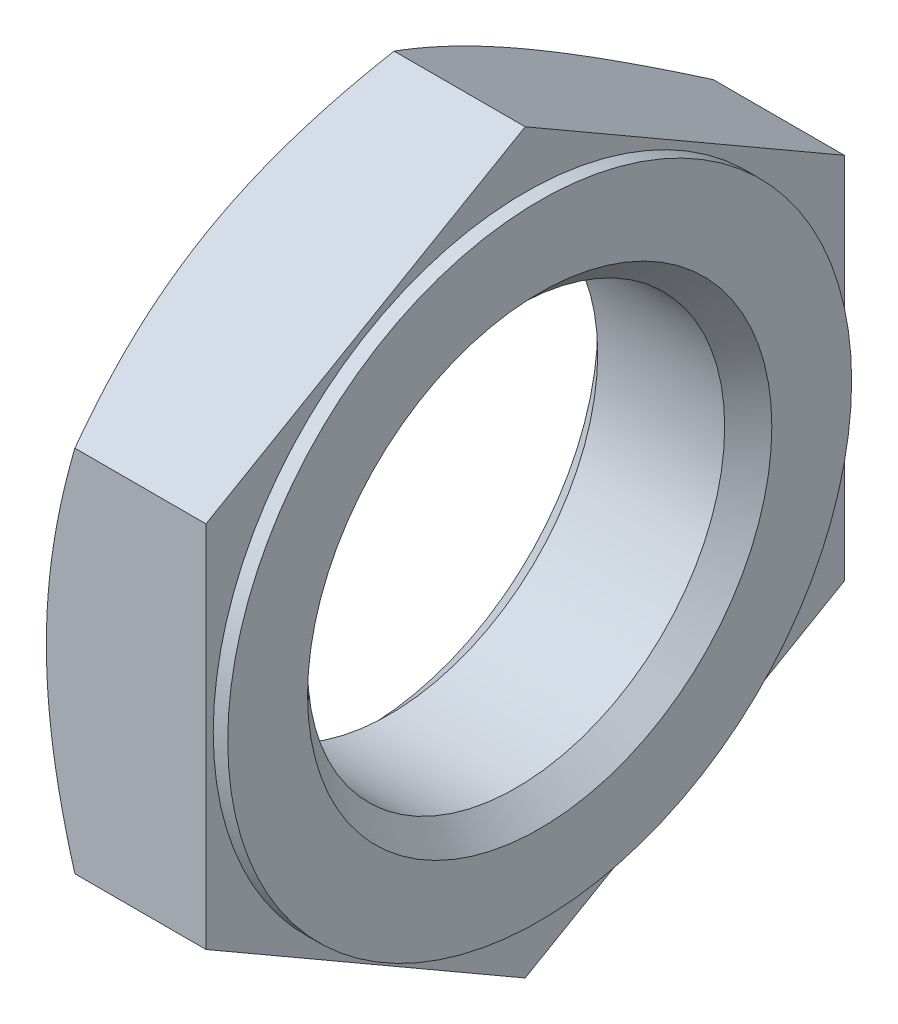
ISO-10303-21;
HEADER;
FILE_DESCRIPTION(('STEP AP214'),'2;1');
FILE_NAME('part.step','',(''),(''),'','','');
FILE_SCHEMA(('AUTOMOTIVE_DESIGN { 1 0 10303 214 1 1 1 1 }'));
ENDSEC;
DATA;
#1=APPLICATION_CONTEXT('core data for automotive mechanical design processes');
#2=APPLICATION_PROTOCOL_DEFINITION('international standard','automotive_design',2000,#1);
#3=PRODUCT_CONTEXT('',#1,'mechanical');
#4=PRODUCT('Part','Part','',(#3));
#5=PRODUCT_RELATED_PRODUCT_CATEGORY('part','',(#4));
#6=PRODUCT_DEFINITION_FORMATION('','',#4);
#7=PRODUCT_DEFINITION_CONTEXT('part definition',#1,'design');
#8=PRODUCT_DEFINITION('design','',#6,#7);
#9=PRODUCT_DEFINITION_SHAPE('','',#8);
#10=(LENGTH_UNIT() NAMED_UNIT(*) SI_UNIT(.MILLI.,.METRE.));
#11=(NAMED_UNIT(*) PLANE_ANGLE_UNIT() SI_UNIT($,.RADIAN.));
#12=(NAMED_UNIT(*) SI_UNIT($,.STERADIAN.) SOLID_ANGLE_UNIT());
#13=UNCERTAINTY_MEASURE_WITH_UNIT(LENGTH_MEASURE(1.E-05),#10,'distance_accuracy_value','');
#14=(GEOMETRIC_REPRESENTATION_CONTEXT(3) GLOBAL_UNCERTAINTY_ASSIGNED_CONTEXT((#13)) GLOBAL_UNIT_ASSIGNED_CONTEXT((#10,
#11,#12)) REPRESENTATION_CONTEXT('',''));
#15=CARTESIAN_POINT('',(0.,0.,0.));
#16=DIRECTION('',(0.,0.,1.));
#17=DIRECTION('',(1.,0.,0.));
#18=AXIS2_PLACEMENT_3D('',#15,#16,#17);
#19=CARTESIAN_POINT('',(5.5,13.2,0.));
#20=DIRECTION('',(-1.,0.,0.));
#21=DIRECTION('',(0.,0.,1.));
#22=AXIS2_PLACEMENT_3D('',#19,#20,#21);
#23=PLANE('',#22);
#24=DIRECTION('',(0.,0.5,0.866025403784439));
#25=VECTOR('',#24,1.);
#26=CARTESIAN_POINT('',(5.5,12.8262794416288,0.215767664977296));
#27=LINE('',#26,#25);
#28=CARTESIAN_POINT('',(5.5,6.35085296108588,-11.));
#29=VERTEX_POINT('',#28);
#30=CARTESIAN_POINT('',(5.5,12.7017059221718,0.));
#31=VERTEX_POINT('',#30);
#32=EDGE_CURVE('E114',#29,#31,#27,.T.);
#33=ORIENTED_EDGE('',*,*,#32,.T.);
#34=DIRECTION('',(0.,-0.5,0.866025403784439));
#35=VECTOR('',#34,1.);
#36=CARTESIAN_POINT('',(5.5,12.8262794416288,-0.215767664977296));
#37=LINE('',#36,#35);
#38=CARTESIAN_POINT('',(5.5,6.35085296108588,11.));
#39=VERTEX_POINT('',#38);
#40=EDGE_CURVE('E11',#31,#39,#37,.T.);
#41=ORIENTED_EDGE('',*,*,#40,.T.);
#42=DIRECTION('',(0.,-1.,0.));
#43=VECTOR('',#42,1.);
#44=CARTESIAN_POINT('',(5.5,13.2,11.));
#45=LINE('',#44,#43);
#46=CARTESIAN_POINT('',(5.5,-6.35085296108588,11.));
#47=VERTEX_POINT('',#46);
#48=EDGE_CURVE('E24',#39,#47,#45,.T.);
#49=ORIENTED_EDGE('',*,*,#48,.T.);
#50=DIRECTION('',(0.,-0.5,-0.866025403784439));
#51=VECTOR('',#50,1.);
#52=CARTESIAN_POINT('',(5.5,-6.22627944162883,11.2157676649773));
#53=LINE('',#52,#51);
#54=CARTESIAN_POINT('',(5.5,-12.7017059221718,0.));
#55=VERTEX_POINT('',#54);
#56=EDGE_CURVE('E128',#47,#55,#53,.T.);
#57=ORIENTED_EDGE('',*,*,#56,.T.);
#58=DIRECTION('',(0.,0.5,-0.866025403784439));
#59=VECTOR('',#58,1.);
#60=CARTESIAN_POINT('',(5.5,-6.22627944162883,-11.2157676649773));
#61=LINE('',#60,#59);
#62=CARTESIAN_POINT('',(5.5,-6.35085296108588,-11.));
#63=VERTEX_POINT('',#62);
#64=EDGE_CURVE('E125',#55,#63,#61,.T.);
#65=ORIENTED_EDGE('',*,*,#64,.T.);
#66=DIRECTION('',(0.,1.,0.));
#67=VECTOR('',#66,1.);
#68=CARTESIAN_POINT('',(5.5,13.2,-11.));
#69=LINE('',#68,#67);
#70=EDGE_CURVE('E122',#63,#29,#69,.T.);
#71=ORIENTED_EDGE('',*,*,#70,.T.);
#72=EDGE_LOOP('',(#33,#41,#49,#57,#65,#71));
#73=FACE_BOUND('',#72,.T.);
#74=CARTESIAN_POINT('',(5.5,0.,0.));
#75=DIRECTION('',(-1.,0.,0.));
#76=DIRECTION('',(0.,0.,1.));
#77=AXIS2_PLACEMENT_3D('',#74,#75,#76);
#78=CIRCLE('',#77,10.75);
#79=CARTESIAN_POINT('',(5.5,0.,10.75));
#80=VERTEX_POINT('',#79);
#81=EDGE_CURVE('E118',#80,#80,#78,.T.);
#82=ORIENTED_EDGE('',*,*,#81,.T.);
#83=EDGE_LOOP('',(#82));
#84=FACE_BOUND('',#83,.T.);
#85=ADVANCED_FACE('F16',(#73,#84),#23,.F.);
#86=CARTESIAN_POINT('',(6.,0.,0.));
#87=DIRECTION('',(-1.,0.,0.));
#88=DIRECTION('',(0.,0.,1.));
#89=AXIS2_PLACEMENT_3D('',#86,#87,#88);
#90=CYLINDRICAL_SURFACE('',#89,10.75);
#91=ORIENTED_EDGE('',*,*,#81,.F.);
#92=EDGE_LOOP('',(#91));
#93=FACE_BOUND('',#92,.T.);
#94=CARTESIAN_POINT('',(6.,0.,0.));
#95=DIRECTION('',(-1.,0.,0.));
#96=DIRECTION('',(0.,0.,1.));
#97=AXIS2_PLACEMENT_3D('',#94,#95,#96);
#98=CIRCLE('',#97,10.75);
#99=CARTESIAN_POINT('',(6.,0.,10.75));
#100=VERTEX_POINT('',#99);
#101=EDGE_CURVE('E475',#100,#100,#98,.T.);
#102=ORIENTED_EDGE('',*,*,#101,.T.);
#103=EDGE_LOOP('',(#102));
#104=FACE_BOUND('',#103,.T.);
#105=ADVANCED_FACE('F218',(#93,#104),#90,.T.);
#106=CARTESIAN_POINT('',(6.,10.75,0.));
#107=DIRECTION('',(-1.,0.,0.));
#108=DIRECTION('',(0.,0.,1.));
#109=AXIS2_PLACEMENT_3D('',#106,#107,#108);
#110=PLANE('',#109);
#111=CARTESIAN_POINT('',(6.,0.,0.));
#112=DIRECTION('',(-1.,0.,0.));
#113=DIRECTION('',(0.,0.,1.));
#114=AXIS2_PLACEMENT_3D('',#111,#112,#113);
#115=CIRCLE('',#114,8.);
#116=CARTESIAN_POINT('',(6.,0.,8.));
#117=VERTEX_POINT('',#116);
#118=EDGE_CURVE('E450',#117,#117,#115,.T.);
#119=ORIENTED_EDGE('',*,*,#118,.T.);
#120=EDGE_LOOP('',(#119));
#121=FACE_BOUND('',#120,.T.);
#122=ORIENTED_EDGE('',*,*,#101,.F.);
#123=EDGE_LOOP('',(#122));
#124=FACE_BOUND('',#123,.T.);
#125=ADVANCED_FACE('F215',(#121,#124),#110,.F.);
#126=CARTESIAN_POINT('',(12.,12.7017059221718,0.));
#127=DIRECTION('',(0.,-0.866025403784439,-0.5));
#128=DIRECTION('',(0.,0.5,-0.866025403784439));
#129=AXIS2_PLACEMENT_3D('',#126,#127,#128);
#130=PLANE('',#129);
#131=DIRECTION('',(-1.,0.,0.));
#132=VECTOR('',#131,1.);
#133=CARTESIAN_POINT('',(12.,6.35085296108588,11.));
#134=LINE('',#133,#132);
#135=CARTESIAN_POINT('',(0.982480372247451,6.35085296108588,11.));
#136=VERTEX_POINT('',#135);
#137=EDGE_CURVE('E91',#39,#136,#134,.T.);
#138=ORIENTED_EDGE('',*,*,#137,.F.);
#139=ORIENTED_EDGE('',*,*,#40,.F.);
#140=DIRECTION('',(-1.,0.,0.));
#141=VECTOR('',#140,1.);
#142=CARTESIAN_POINT('',(12.,12.7017059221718,0.));
#143=LINE('',#142,#141);
#144=CARTESIAN_POINT('',(0.98248037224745,12.7017059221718,0.));
#145=VERTEX_POINT('',#144);
#146=EDGE_CURVE('E37',#31,#145,#143,.T.);
#147=ORIENTED_EDGE('',*,*,#146,.T.);
#148=CARTESIAN_POINT('',(0.9825470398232,6.35073749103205,11.0002));
#149=CARTESIAN_POINT('',(0.901959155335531,6.49034297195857,10.7583962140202));
#150=CARTESIAN_POINT('',(0.825028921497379,6.63046897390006,10.515690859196));
#151=CARTESIAN_POINT('',(0.67949864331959,6.91184468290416,10.0283338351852));
#152=CARTESIAN_POINT('',(0.610901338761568,7.05309474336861,9.78368155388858));
#153=CARTESIAN_POINT('',(0.418936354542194,7.47912088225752,9.0457826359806));
#154=CARTESIAN_POINT('',(0.309747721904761,7.7655787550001,8.54962304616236));
#155=CARTESIAN_POINT('',(0.18171411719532,8.19424982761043,7.80714296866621));
#156=CARTESIAN_POINT('',(0.145242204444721,8.33518236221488,7.56304065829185));
#157=CARTESIAN_POINT('',(0.0840813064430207,8.61769996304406,7.07370581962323));
#158=CARTESIAN_POINT('',(0.059392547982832,8.75928504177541,6.82847326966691));
#159=CARTESIAN_POINT('',(0.0224303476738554,9.04269125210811,6.33759931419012));
#160=CARTESIAN_POINT('',(0.0101421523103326,9.18451190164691,6.09195874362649));
#161=CARTESIAN_POINT('',(-0.0017570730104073,9.468284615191,5.60044998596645));
#162=CARTESIAN_POINT('',(-0.00136849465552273,9.61023667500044,5.35458180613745));
#163=CARTESIAN_POINT('',(0.011201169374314,9.87561687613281,4.89492981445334));
#164=CARTESIAN_POINT('',(0.0218490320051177,9.99906394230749,4.68111322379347));
#165=CARTESIAN_POINT('',(0.0525316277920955,10.2456741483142,4.25397181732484));
#166=CARTESIAN_POINT('',(0.0725670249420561,10.3688372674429,4.0406470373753));
#167=CARTESIAN_POINT('',(0.121675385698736,10.6148126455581,3.61460518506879));
#168=CARTESIAN_POINT('',(0.150755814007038,10.7376245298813,3.40188876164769));
#169=CARTESIAN_POINT('',(0.217443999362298,10.9826725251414,2.97745318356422));
#170=CARTESIAN_POINT('',(0.255052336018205,11.1049085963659,2.76573409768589));
#171=CARTESIAN_POINT('',(0.381619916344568,11.4759630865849,2.12304886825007));
#172=CARTESIAN_POINT('',(0.483199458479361,11.7237069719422,1.69394387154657));
#173=CARTESIAN_POINT('',(0.713743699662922,12.2155005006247,0.842132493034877));
#174=CARTESIAN_POINT('',(0.842654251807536,12.4595564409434,0.419415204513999));
#175=CARTESIAN_POINT('',(0.982547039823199,12.7018213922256,-0.000200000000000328));
#176=B_SPLINE_CURVE_WITH_KNOTS('',3,(#148,#149,#150,#151,#152,#153,#154,#155,#156,#157,#158,
#159,#160,#161,#162,#163,#164,#165,#166,#167,#168,#169,#170,#171,#172,#173,#174,#175),
.UNSPECIFIED.,.F.,.F.,(4,2,2,2,2,2,2,2,2,2,2,2,2,4),(0.,0.871755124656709,1.74379610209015,
3.49159027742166,4.34403665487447,5.19649943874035,6.0479468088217,6.89936787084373,
7.64056020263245,8.38180496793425,9.1236630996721,9.86557166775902,11.3820155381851,
12.8954827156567),.UNSPECIFIED.);
#177=CARTESIAN_POINT('',(0.,9.52627944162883,5.5));
#178=VERTEX_POINT('',#177);
#179=EDGE_CURVE('E100',#178,#145,#176,.T.);
#180=ORIENTED_EDGE('',*,*,#179,.F.);
#181=EDGE_CURVE('E144',#136,#178,#176,.T.);
#182=ORIENTED_EDGE('',*,*,#181,.F.);
#183=EDGE_LOOP('',(#138,#139,#147,#180,#182));
#184=FACE_BOUND('',#183,.T.);
#185=ADVANCED_FACE('F142',(#184),#130,.F.);
#186=CARTESIAN_POINT('',(12.,6.35085296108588,11.));
#187=DIRECTION('',(0.,0.,-1.));
#188=DIRECTION('',(-1.,0.,0.));
#189=AXIS2_PLACEMENT_3D('',#186,#187,#188);
#190=PLANE('',#189);
#191=DIRECTION('',(-1.,0.,0.));
#192=VECTOR('',#191,1.);
#193=CARTESIAN_POINT('',(12.,-6.35085296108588,11.));
#194=LINE('',#193,#192);
#195=CARTESIAN_POINT('',(0.982480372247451,-6.35085296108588,11.));
#196=VERTEX_POINT('',#195);
#197=EDGE_CURVE('E140',#47,#196,#194,.T.);
#198=ORIENTED_EDGE('',*,*,#197,.F.);
#199=ORIENTED_EDGE('',*,*,#48,.F.);
#200=ORIENTED_EDGE('',*,*,#137,.T.);
#201=CARTESIAN_POINT('',(5.28310541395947,-16.8833338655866,11.));
#202=CARTESIAN_POINT('',(5.16725805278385,-16.6438448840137,11.));
#203=CARTESIAN_POINT('',(5.05200187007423,-16.4040700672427,11.));
#204=CARTESIAN_POINT('',(4.82280612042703,-15.9238890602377,11.));
#205=CARTESIAN_POINT('',(4.7088665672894,-15.6834828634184,11.));
#206=CARTESIAN_POINT('',(4.36919304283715,-14.9611611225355,11.));
#207=CARTESIAN_POINT('',(4.14563992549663,-14.4782160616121,11.));
#208=CARTESIAN_POINT('',(3.70449349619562,-13.5063208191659,11.));
#209=CARTESIAN_POINT('',(3.4869408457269,-13.0173521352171,11.));
#210=CARTESIAN_POINT('',(3.06097328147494,-12.0354643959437,11.));
#211=CARTESIAN_POINT('',(2.85255792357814,-11.542545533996,11.));
#212=CARTESIAN_POINT('',(2.44106281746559,-10.5367539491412,11.));
#213=CARTESIAN_POINT('',(2.23834309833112,-10.0237330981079,11.));
#214=CARTESIAN_POINT('',(1.84867621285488,-8.99162608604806,11.));
#215=CARTESIAN_POINT('',(1.66173084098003,-8.47253924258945,11.));
#216=CARTESIAN_POINT('',(1.30865076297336,-7.42849793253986,11.));
#217=CARTESIAN_POINT('',(1.14247235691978,-6.9035584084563,11.));
#218=CARTESIAN_POINT('',(0.83637146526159,-5.84617188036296,11.));
#219=CARTESIAN_POINT('',(0.696440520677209,-5.31372735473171,11.));
#220=CARTESIAN_POINT('',(0.450409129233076,-4.24386061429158,11.));
#221=CARTESIAN_POINT('',(0.344131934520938,-3.70648019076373,11.));
#222=CARTESIAN_POINT('',(0.21464355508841,-2.89565985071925,11.));
#223=CARTESIAN_POINT('',(0.176466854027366,-2.62457345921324,11.));
#224=CARTESIAN_POINT('',(0.110841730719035,-2.08111390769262,11.));
#225=CARTESIAN_POINT('',(0.0833922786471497,-1.8087408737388,11.));
#226=CARTESIAN_POINT('',(0.0401037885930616,-1.26655259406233,11.));
#227=CARTESIAN_POINT('',(0.0241216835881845,-0.996748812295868,11.));
#228=CARTESIAN_POINT('',(0.003567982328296,-0.456707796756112,11.));
#229=CARTESIAN_POINT('',(-0.00100379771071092,-0.186470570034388,11.));
#230=CARTESIAN_POINT('',(0.00137187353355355,0.353956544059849,11.));
#231=CARTESIAN_POINT('',(0.00831942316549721,0.624146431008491,11.));
#232=CARTESIAN_POINT('',(0.03356734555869,1.16399898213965,11.));
#233=CARTESIAN_POINT('',(0.0518682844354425,1.43366161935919,11.));
#234=CARTESIAN_POINT('',(0.109596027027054,2.08717708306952,11.));
#235=CARTESIAN_POINT('',(0.154710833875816,2.47053588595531,11.));
#236=CARTESIAN_POINT('',(0.265385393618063,3.23429321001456,11.));
#237=CARTESIAN_POINT('',(0.330948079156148,3.61469129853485,11.));
#238=CARTESIAN_POINT('',(0.48018567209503,4.37220473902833,11.));
#239=CARTESIAN_POINT('',(0.563875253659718,4.74931717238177,11.));
#240=CARTESIAN_POINT('',(0.746823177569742,5.49970362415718,11.));
#241=CARTESIAN_POINT('',(0.846081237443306,5.87297771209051,11.));
#242=CARTESIAN_POINT('',(1.06007076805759,6.62376545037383,11.));
#243=CARTESIAN_POINT('',(1.17509021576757,7.00119645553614,11.));
#244=CARTESIAN_POINT('',(1.41663178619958,7.7523391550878,11.));
#245=CARTESIAN_POINT('',(1.54315398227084,8.12605082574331,11.));
#246=CARTESIAN_POINT('',(1.80572582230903,8.869945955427,11.));
#247=CARTESIAN_POINT('',(1.9417720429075,9.24013062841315,11.));
#248=CARTESIAN_POINT('',(2.22182898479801,9.9774585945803,11.));
#249=CARTESIAN_POINT('',(2.36583963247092,10.344601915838,11.));
#250=CARTESIAN_POINT('',(2.70153609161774,11.1780876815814,11.));
#251=CARTESIAN_POINT('',(2.89532938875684,11.643579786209,11.));
#252=CARTESIAN_POINT('',(3.29158224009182,12.570870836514,11.));
#253=CARTESIAN_POINT('',(3.49404222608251,13.0326695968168,11.));
#254=CARTESIAN_POINT('',(3.90597881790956,13.9532208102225,11.));
#255=CARTESIAN_POINT('',(4.11545670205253,14.4119726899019,11.));
#256=CARTESIAN_POINT('',(4.54008629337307,15.326827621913,11.));
#257=CARTESIAN_POINT('',(4.75523790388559,15.7829307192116,11.));
#258=CARTESIAN_POINT('',(5.19041001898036,16.6933361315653,11.));
#259=CARTESIAN_POINT('',(5.4104349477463,17.147636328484,11.));
#260=CARTESIAN_POINT('',(5.85435756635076,18.0543400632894,11.));
#261=CARTESIAN_POINT('',(6.07825526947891,18.5067435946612,11.));
#262=CARTESIAN_POINT('',(6.52926426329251,19.4098844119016,11.));
#263=CARTESIAN_POINT('',(6.75637521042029,19.8606218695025,11.));
#264=CARTESIAN_POINT('',(7.21333047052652,20.7607098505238,11.));
#265=CARTESIAN_POINT('',(7.44317479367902,21.2100603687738,11.));
#266=CARTESIAN_POINT('',(8.10020236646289,22.4864383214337,11.));
#267=CARTESIAN_POINT('',(8.53016302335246,23.3120361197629,11.));
#268=CARTESIAN_POINT('',(9.39601965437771,24.9601368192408,11.));
#269=CARTESIAN_POINT('',(9.83191580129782,25.7826396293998,11.));
#270=CARTESIAN_POINT('',(10.7073262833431,27.423392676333,11.));
#271=CARTESIAN_POINT('',(11.1468305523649,28.2416482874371,11.));
#272=CARTESIAN_POINT('',(11.8087720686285,29.4675545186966,11.));
#273=CARTESIAN_POINT('',(12.0298614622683,29.8759340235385,11.));
#274=CARTESIAN_POINT('',(12.4728473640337,30.6922542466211,11.));
#275=CARTESIAN_POINT('',(12.6947438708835,31.1001949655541,11.));
#276=CARTESIAN_POINT('',(12.916998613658,31.5079404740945,11.));
#277=B_SPLINE_CURVE_WITH_KNOTS('',3,(#201,#202,#203,#204,#205,#206,#207,#208,#209,#210,#211,
#212,#213,#214,#215,#216,#217,#218,#219,#220,#221,#222,#223,#224,#225,#226,#227,#228,#229,#230,
#231,#232,#233,#234,#235,#236,#237,#238,#239,#240,#241,#242,#243,#244,#245,#246,#247,#248,#249,
#250,#251,#252,#253,#254,#255,#256,#257,#258,#259,#260,#261,#262,#263,#264,#265,#266,#267,#268,
#269,#270,#271,#272,#273,#274,#275,#276),.UNSPECIFIED.,.F.,.F.,(4,2,2,2,2,2,2,2,2,2,2,2,2,2,2,2,
2,2,2,2,2,2,2,2,2,2,2,2,2,2,2,2,2,2,2,2,2,4),(0.,0.798108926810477,1.59622621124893,
3.19270628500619,4.79817865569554,6.40357290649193,8.05823473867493,9.71308454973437,
11.3643912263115,13.0151648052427,14.6571190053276,15.478224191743,16.2992505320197,
17.1098466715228,17.9204297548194,18.7310197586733,19.5416501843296,20.6990186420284,
21.8565531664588,23.0150282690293,24.1734823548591,25.3569653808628,26.5404559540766,
27.7235232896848,28.9065796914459,30.4191266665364,31.9317490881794,33.444648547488,
34.9575222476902,36.4718307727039,37.9861444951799,39.5002975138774,41.0144561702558,
43.8069638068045,46.5995529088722,49.3860001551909,50.7791574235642,52.1723124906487),.UNSPECIFIED.);
#278=CARTESIAN_POINT('',(0.,0.,11.));
#279=VERTEX_POINT('',#278);
#280=EDGE_CURVE('E198',#279,#136,#277,.T.);
#281=ORIENTED_EDGE('',*,*,#280,.F.);
#282=EDGE_CURVE('E204',#196,#279,#277,.T.);
#283=ORIENTED_EDGE('',*,*,#282,.F.);
#284=EDGE_LOOP('',(#198,#199,#200,#281,#283));
#285=FACE_BOUND('',#284,.T.);
#286=ADVANCED_FACE('F137',(#285),#190,.F.);
#287=CARTESIAN_POINT('',(12.,-6.35085296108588,11.));
#288=DIRECTION('',(0.,0.866025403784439,-0.5));
#289=DIRECTION('',(0.,0.5,0.866025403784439));
#290=AXIS2_PLACEMENT_3D('',#287,#288,#289);
#291=PLANE('',#290);
#292=DIRECTION('',(-1.,0.,0.));
#293=VECTOR('',#292,1.);
#294=CARTESIAN_POINT('',(12.,-12.7017059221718,0.));
#295=LINE('',#294,#293);
#296=CARTESIAN_POINT('',(0.98248037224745,-12.7017059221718,0.));
#297=VERTEX_POINT('',#296);
#298=EDGE_CURVE('E146',#55,#297,#295,.T.);
#299=ORIENTED_EDGE('',*,*,#298,.F.);
#300=ORIENTED_EDGE('',*,*,#56,.F.);
#301=ORIENTED_EDGE('',*,*,#197,.T.);
#302=CARTESIAN_POINT('',(0.982547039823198,-12.7018213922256,-0.0002));
#303=CARTESIAN_POINT('',(0.901959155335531,-12.5622159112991,0.241603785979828));
#304=CARTESIAN_POINT('',(0.825028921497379,-12.4220899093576,0.484309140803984));
#305=CARTESIAN_POINT('',(0.67949864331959,-12.1407142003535,0.971666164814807));
#306=CARTESIAN_POINT('',(0.610901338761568,-11.999464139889,1.21631844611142));
#307=CARTESIAN_POINT('',(0.418936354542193,-11.5734380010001,1.9542173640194));
#308=CARTESIAN_POINT('',(0.30974772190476,-11.2869801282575,2.45037695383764));
#309=CARTESIAN_POINT('',(0.18171411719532,-10.8583090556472,3.19285703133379));
#310=CARTESIAN_POINT('',(0.145242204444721,-10.7173765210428,3.43695934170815));
#311=CARTESIAN_POINT('',(0.0840813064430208,-10.4348589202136,3.92629418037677));
#312=CARTESIAN_POINT('',(0.0593925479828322,-10.2932738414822,4.17152673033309));
#313=CARTESIAN_POINT('',(0.0224303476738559,-10.0098676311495,4.66240068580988));
#314=CARTESIAN_POINT('',(0.0101421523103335,-9.86804698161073,4.90804125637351));
#315=CARTESIAN_POINT('',(-0.00175707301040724,-9.58427426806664,5.39955001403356));
#316=CARTESIAN_POINT('',(-0.00136849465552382,-9.44232220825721,5.64541819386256));
#317=CARTESIAN_POINT('',(0.0112011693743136,-9.17694200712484,6.10507018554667));
#318=CARTESIAN_POINT('',(0.0218490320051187,-9.05349494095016,6.31888677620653));
#319=CARTESIAN_POINT('',(0.0525316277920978,-8.80688473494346,6.74602818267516));
#320=CARTESIAN_POINT('',(0.0725670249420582,-8.68372161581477,6.9593529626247));
#321=CARTESIAN_POINT('',(0.121675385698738,-8.43774623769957,7.38539481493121));
#322=CARTESIAN_POINT('',(0.15075581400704,-8.31493435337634,7.5981112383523));
#323=CARTESIAN_POINT('',(0.2174439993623,-8.06988635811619,8.02254681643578));
#324=CARTESIAN_POINT('',(0.255052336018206,-7.94765028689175,8.23426590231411));
#325=CARTESIAN_POINT('',(0.381619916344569,-7.57659579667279,8.87695113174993));
#326=CARTESIAN_POINT('',(0.483199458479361,-7.32885191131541,9.30605612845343));
#327=CARTESIAN_POINT('',(0.713743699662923,-6.8370583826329,10.1578675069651));
#328=CARTESIAN_POINT('',(0.842654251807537,-6.59300244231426,10.580584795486));
#329=CARTESIAN_POINT('',(0.9825470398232,-6.35073749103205,11.0002));
#330=B_SPLINE_CURVE_WITH_KNOTS('',3,(#302,#303,#304,#305,#306,#307,#308,#309,#310,#311,#312,
#313,#314,#315,#316,#317,#318,#319,#320,#321,#322,#323,#324,#325,#326,#327,#328,#329),
.UNSPECIFIED.,.F.,.F.,(4,2,2,2,2,2,2,2,2,2,2,2,2,4),(0.,0.871755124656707,1.74379610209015,
3.49159027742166,4.34403665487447,5.19649943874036,6.04794680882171,6.89936787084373,
7.64056020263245,8.38180496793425,9.1236630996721,9.86557166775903,11.3820155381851,
12.8954827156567),.UNSPECIFIED.);
#331=CARTESIAN_POINT('',(0.,-9.52627944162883,5.5));
#332=VERTEX_POINT('',#331);
#333=EDGE_CURVE('E190',#332,#196,#330,.T.);
#334=ORIENTED_EDGE('',*,*,#333,.F.);
#335=EDGE_CURVE('E197',#297,#332,#330,.T.);
#336=ORIENTED_EDGE('',*,*,#335,.F.);
#337=EDGE_LOOP('',(#299,#300,#301,#334,#336));
#338=FACE_BOUND('',#337,.T.);
#339=ADVANCED_FACE('F178',(#338),#291,.F.);
#340=CARTESIAN_POINT('',(12.,-12.7017059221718,0.));
#341=DIRECTION('',(0.,0.866025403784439,0.5));
#342=DIRECTION('',(0.,-0.5,0.866025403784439));
#343=AXIS2_PLACEMENT_3D('',#340,#341,#342);
#344=PLANE('',#343);
#345=DIRECTION('',(-1.,0.,0.));
#346=VECTOR('',#345,1.);
#347=CARTESIAN_POINT('',(12.,-6.35085296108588,-11.));
#348=LINE('',#347,#346);
#349=CARTESIAN_POINT('',(0.982480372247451,-6.35085296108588,-11.));
#350=VERTEX_POINT('',#349);
#351=EDGE_CURVE('E462',#63,#350,#348,.T.);
#352=ORIENTED_EDGE('',*,*,#351,.F.);
#353=ORIENTED_EDGE('',*,*,#64,.F.);
#354=ORIENTED_EDGE('',*,*,#298,.T.);
#355=CARTESIAN_POINT('',(0.9825470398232,-6.35073749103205,-11.0002));
#356=CARTESIAN_POINT('',(0.901959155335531,-6.49034297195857,-10.7583962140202));
#357=CARTESIAN_POINT('',(0.825028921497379,-6.63046897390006,-10.515690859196));
#358=CARTESIAN_POINT('',(0.67949864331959,-6.91184468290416,-10.0283338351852));
#359=CARTESIAN_POINT('',(0.610901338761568,-7.05309474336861,-9.78368155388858));
#360=CARTESIAN_POINT('',(0.418936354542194,-7.47912088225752,-9.0457826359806));
#361=CARTESIAN_POINT('',(0.309747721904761,-7.7655787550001,-8.54962304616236));
#362=CARTESIAN_POINT('',(0.18171411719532,-8.19424982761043,-7.80714296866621));
#363=CARTESIAN_POINT('',(0.145242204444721,-8.33518236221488,-7.56304065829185));
#364=CARTESIAN_POINT('',(0.0840813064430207,-8.61769996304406,-7.07370581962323));
#365=CARTESIAN_POINT('',(0.059392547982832,-8.75928504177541,-6.82847326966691));
#366=CARTESIAN_POINT('',(0.0224303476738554,-9.04269125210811,-6.33759931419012));
#367=CARTESIAN_POINT('',(0.0101421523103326,-9.18451190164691,-6.09195874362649));
#368=CARTESIAN_POINT('',(-0.0017570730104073,-9.468284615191,-5.60044998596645));
#369=CARTESIAN_POINT('',(-0.00136849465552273,-9.61023667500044,-5.35458180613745));
#370=CARTESIAN_POINT('',(0.011201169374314,-9.87561687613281,-4.89492981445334));
#371=CARTESIAN_POINT('',(0.0218490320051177,-9.99906394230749,-4.68111322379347));
#372=CARTESIAN_POINT('',(0.0525316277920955,-10.2456741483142,-4.25397181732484));
#373=CARTESIAN_POINT('',(0.0725670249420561,-10.3688372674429,-4.0406470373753));
#374=CARTESIAN_POINT('',(0.121675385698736,-10.6148126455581,-3.61460518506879));
#375=CARTESIAN_POINT('',(0.150755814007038,-10.7376245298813,-3.40188876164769));
#376=CARTESIAN_POINT('',(0.217443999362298,-10.9826725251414,-2.97745318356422));
#377=CARTESIAN_POINT('',(0.255052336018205,-11.1049085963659,-2.76573409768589));
#378=CARTESIAN_POINT('',(0.381619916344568,-11.4759630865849,-2.12304886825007));
#379=CARTESIAN_POINT('',(0.483199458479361,-11.7237069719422,-1.69394387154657));
#380=CARTESIAN_POINT('',(0.713743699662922,-12.2155005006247,-0.842132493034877));
#381=CARTESIAN_POINT('',(0.842654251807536,-12.4595564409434,-0.419415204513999));
#382=CARTESIAN_POINT('',(0.982547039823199,-12.7018213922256,0.000200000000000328));
#383=B_SPLINE_CURVE_WITH_KNOTS('',3,(#355,#356,#357,#358,#359,#360,#361,#362,#363,#364,#365,
#366,#367,#368,#369,#370,#371,#372,#373,#374,#375,#376,#377,#378,#379,#380,#381,#382),
.UNSPECIFIED.,.F.,.F.,(4,2,2,2,2,2,2,2,2,2,2,2,2,4),(0.,0.871755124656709,1.74379610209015,
3.49159027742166,4.34403665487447,5.19649943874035,6.0479468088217,6.89936787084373,
7.64056020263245,8.38180496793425,9.1236630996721,9.86557166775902,11.3820155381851,
12.8954827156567),.UNSPECIFIED.);
#384=CARTESIAN_POINT('',(0.,-9.52627944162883,-5.5));
#385=VERTEX_POINT('',#384);
#386=EDGE_CURVE('E182',#385,#297,#383,.T.);
#387=ORIENTED_EDGE('',*,*,#386,.F.);
#388=EDGE_CURVE('E189',#350,#385,#383,.T.);
#389=ORIENTED_EDGE('',*,*,#388,.F.);
#390=EDGE_LOOP('',(#352,#353,#354,#387,#389));
#391=FACE_BOUND('',#390,.T.);
#392=ADVANCED_FACE('F173',(#391),#344,.F.);
#393=CARTESIAN_POINT('',(12.,-6.35085296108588,-11.));
#394=DIRECTION('',(0.,0.,1.));
#395=DIRECTION('',(1.,0.,0.));
#396=AXIS2_PLACEMENT_3D('',#393,#394,#395);
#397=PLANE('',#396);
#398=DIRECTION('',(-1.,0.,0.));
#399=VECTOR('',#398,1.);
#400=CARTESIAN_POINT('',(12.,6.35085296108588,-11.));
#401=LINE('',#400,#399);
#402=CARTESIAN_POINT('',(0.98248037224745,6.35085296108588,-11.));
#403=VERTEX_POINT('',#402);
#404=EDGE_CURVE('E31',#29,#403,#401,.T.);
#405=ORIENTED_EDGE('',*,*,#404,.F.);
#406=ORIENTED_EDGE('',*,*,#70,.F.);
#407=ORIENTED_EDGE('',*,*,#351,.T.);
#408=CARTESIAN_POINT('',(5.28310541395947,-16.8833338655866,-11.));
#409=CARTESIAN_POINT('',(5.16725805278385,-16.6438448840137,-11.));
#410=CARTESIAN_POINT('',(5.05200187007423,-16.4040700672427,-11.));
#411=CARTESIAN_POINT('',(4.82280612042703,-15.9238890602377,-11.));
#412=CARTESIAN_POINT('',(4.7088665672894,-15.6834828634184,-11.));
#413=CARTESIAN_POINT('',(4.36919304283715,-14.9611611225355,-11.));
#414=CARTESIAN_POINT('',(4.14563992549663,-14.4782160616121,-11.));
#415=CARTESIAN_POINT('',(3.70449349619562,-13.5063208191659,-11.));
#416=CARTESIAN_POINT('',(3.4869408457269,-13.0173521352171,-11.));
#417=CARTESIAN_POINT('',(3.06097328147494,-12.0354643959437,-11.));
#418=CARTESIAN_POINT('',(2.85255792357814,-11.542545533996,-11.));
#419=CARTESIAN_POINT('',(2.44106281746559,-10.5367539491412,-11.));
#420=CARTESIAN_POINT('',(2.23834309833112,-10.0237330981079,-11.));
#421=CARTESIAN_POINT('',(1.84867621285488,-8.99162608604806,-11.));
#422=CARTESIAN_POINT('',(1.66173084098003,-8.47253924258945,-11.));
#423=CARTESIAN_POINT('',(1.30865076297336,-7.42849793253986,-11.));
#424=CARTESIAN_POINT('',(1.14247235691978,-6.9035584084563,-11.));
#425=CARTESIAN_POINT('',(0.83637146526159,-5.84617188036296,-11.));
#426=CARTESIAN_POINT('',(0.696440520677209,-5.31372735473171,-11.));
#427=CARTESIAN_POINT('',(0.450409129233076,-4.24386061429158,-11.));
#428=CARTESIAN_POINT('',(0.344131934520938,-3.70648019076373,-11.));
#429=CARTESIAN_POINT('',(0.21464355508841,-2.89565985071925,-11.));
#430=CARTESIAN_POINT('',(0.176466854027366,-2.62457345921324,-11.));
#431=CARTESIAN_POINT('',(0.110841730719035,-2.08111390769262,-11.));
#432=CARTESIAN_POINT('',(0.0833922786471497,-1.8087408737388,-11.));
#433=CARTESIAN_POINT('',(0.0401037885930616,-1.26655259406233,-11.));
#434=CARTESIAN_POINT('',(0.0241216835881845,-0.996748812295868,-11.));
#435=CARTESIAN_POINT('',(0.003567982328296,-0.456707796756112,-11.));
#436=CARTESIAN_POINT('',(-0.00100379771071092,-0.186470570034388,-11.));
#437=CARTESIAN_POINT('',(0.00137187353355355,0.353956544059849,-11.));
#438=CARTESIAN_POINT('',(0.00831942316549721,0.624146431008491,-11.));
#439=CARTESIAN_POINT('',(0.03356734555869,1.16399898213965,-11.));
#440=CARTESIAN_POINT('',(0.0518682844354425,1.43366161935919,-11.));
#441=CARTESIAN_POINT('',(0.109596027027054,2.08717708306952,-11.));
#442=CARTESIAN_POINT('',(0.154710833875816,2.47053588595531,-11.));
#443=CARTESIAN_POINT('',(0.265385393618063,3.23429321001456,-11.));
#444=CARTESIAN_POINT('',(0.330948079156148,3.61469129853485,-11.));
#445=CARTESIAN_POINT('',(0.48018567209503,4.37220473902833,-11.));
#446=CARTESIAN_POINT('',(0.563875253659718,4.74931717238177,-11.));
#447=CARTESIAN_POINT('',(0.746823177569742,5.49970362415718,-11.));
#448=CARTESIAN_POINT('',(0.846081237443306,5.87297771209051,-11.));
#449=CARTESIAN_POINT('',(1.06007076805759,6.62376545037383,-11.));
#450=CARTESIAN_POINT('',(1.17509021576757,7.00119645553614,-11.));
#451=CARTESIAN_POINT('',(1.41663178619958,7.7523391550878,-11.));
#452=CARTESIAN_POINT('',(1.54315398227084,8.12605082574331,-11.));
#453=CARTESIAN_POINT('',(1.80572582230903,8.869945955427,-11.));
#454=CARTESIAN_POINT('',(1.9417720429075,9.24013062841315,-11.));
#455=CARTESIAN_POINT('',(2.22182898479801,9.9774585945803,-11.));
#456=CARTESIAN_POINT('',(2.36583963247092,10.344601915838,-11.));
#457=CARTESIAN_POINT('',(2.70153609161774,11.1780876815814,-11.));
#458=CARTESIAN_POINT('',(2.89532938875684,11.643579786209,-11.));
#459=CARTESIAN_POINT('',(3.29158224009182,12.570870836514,-11.));
#460=CARTESIAN_POINT('',(3.49404222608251,13.0326695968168,-11.));
#461=CARTESIAN_POINT('',(3.90597881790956,13.9532208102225,-11.));
#462=CARTESIAN_POINT('',(4.11545670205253,14.4119726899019,-11.));
#463=CARTESIAN_POINT('',(4.54008629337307,15.326827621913,-11.));
#464=CARTESIAN_POINT('',(4.75523790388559,15.7829307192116,-11.));
#465=CARTESIAN_POINT('',(5.19041001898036,16.6933361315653,-11.));
#466=CARTESIAN_POINT('',(5.4104349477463,17.147636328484,-11.));
#467=CARTESIAN_POINT('',(5.85435756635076,18.0543400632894,-11.));
#468=CARTESIAN_POINT('',(6.07825526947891,18.5067435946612,-11.));
#469=CARTESIAN_POINT('',(6.52926426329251,19.4098844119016,-11.));
#470=CARTESIAN_POINT('',(6.75637521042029,19.8606218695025,-11.));
#471=CARTESIAN_POINT('',(7.21333047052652,20.7607098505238,-11.));
#472=CARTESIAN_POINT('',(7.44317479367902,21.2100603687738,-11.));
#473=CARTESIAN_POINT('',(8.10020236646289,22.4864383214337,-11.));
#474=CARTESIAN_POINT('',(8.53016302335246,23.3120361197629,-11.));
#475=CARTESIAN_POINT('',(9.39601965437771,24.9601368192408,-11.));
#476=CARTESIAN_POINT('',(9.83191580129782,25.7826396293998,-11.));
#477=CARTESIAN_POINT('',(10.7073262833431,27.423392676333,-11.));
#478=CARTESIAN_POINT('',(11.1468305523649,28.2416482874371,-11.));
#479=CARTESIAN_POINT('',(11.8087720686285,29.4675545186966,-11.));
#480=CARTESIAN_POINT('',(12.0298614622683,29.8759340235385,-11.));
#481=CARTESIAN_POINT('',(12.4728473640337,30.6922542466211,-11.));
#482=CARTESIAN_POINT('',(12.6947438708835,31.1001949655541,-11.));
#483=CARTESIAN_POINT('',(12.916998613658,31.5079404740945,-11.));
#484=B_SPLINE_CURVE_WITH_KNOTS('',3,(#408,#409,#410,#411,#412,#413,#414,#415,#416,#417,#418,
#419,#420,#421,#422,#423,#424,#425,#426,#427,#428,#429,#430,#431,#432,#433,#434,#435,#436,#437,
#438,#439,#440,#441,#442,#443,#444,#445,#446,#447,#448,#449,#450,#451,#452,#453,#454,#455,#456,
#457,#458,#459,#460,#461,#462,#463,#464,#465,#466,#467,#468,#469,#470,#471,#472,#473,#474,#475,
#476,#477,#478,#479,#480,#481,#482,#483),.UNSPECIFIED.,.F.,.F.,(4,2,2,2,2,2,2,2,2,2,2,2,2,2,2,2,
2,2,2,2,2,2,2,2,2,2,2,2,2,2,2,2,2,2,2,2,2,4),(0.,0.798108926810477,1.59622621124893,
3.19270628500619,4.79817865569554,6.40357290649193,8.05823473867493,9.71308454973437,
11.3643912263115,13.0151648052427,14.6571190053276,15.478224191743,16.2992505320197,
17.1098466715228,17.9204297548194,18.7310197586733,19.5416501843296,20.6990186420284,
21.8565531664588,23.0150282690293,24.1734823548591,25.3569653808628,26.5404559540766,
27.7235232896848,28.9065796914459,30.4191266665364,31.9317490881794,33.444648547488,
34.9575222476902,36.4718307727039,37.9861444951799,39.5002975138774,41.0144561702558,
43.8069638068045,46.5995529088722,49.3860001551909,50.7791574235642,52.1723124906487),.UNSPECIFIED.);
#485=CARTESIAN_POINT('',(0.,0.,-11.));
#486=VERTEX_POINT('',#485);
#487=EDGE_CURVE('E101',#486,#350,#484,.F.);
#488=ORIENTED_EDGE('',*,*,#487,.F.);
#489=EDGE_CURVE('E105',#403,#486,#484,.F.);
#490=ORIENTED_EDGE('',*,*,#489,.F.);
#491=EDGE_LOOP('',(#405,#406,#407,#488,#490));
#492=FACE_BOUND('',#491,.T.);
#493=ADVANCED_FACE('F167',(#492),#397,.F.);
#494=CARTESIAN_POINT('',(12.,6.35085296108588,-11.));
#495=DIRECTION('',(0.,-0.866025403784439,0.5));
#496=DIRECTION('',(0.,-0.5,-0.866025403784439));
#497=AXIS2_PLACEMENT_3D('',#494,#495,#496);
#498=PLANE('',#497);
#499=ORIENTED_EDGE('',*,*,#146,.F.);
#500=ORIENTED_EDGE('',*,*,#32,.F.);
#501=ORIENTED_EDGE('',*,*,#404,.T.);
#502=CARTESIAN_POINT('',(0.982547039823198,12.7018213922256,0.0002));
#503=CARTESIAN_POINT('',(0.901959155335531,12.5622159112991,-0.241603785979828));
#504=CARTESIAN_POINT('',(0.825028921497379,12.4220899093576,-0.484309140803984));
#505=CARTESIAN_POINT('',(0.67949864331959,12.1407142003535,-0.971666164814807));
#506=CARTESIAN_POINT('',(0.610901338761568,11.999464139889,-1.21631844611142));
#507=CARTESIAN_POINT('',(0.418936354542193,11.5734380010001,-1.9542173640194));
#508=CARTESIAN_POINT('',(0.30974772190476,11.2869801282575,-2.45037695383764));
#509=CARTESIAN_POINT('',(0.18171411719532,10.8583090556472,-3.19285703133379));
#510=CARTESIAN_POINT('',(0.145242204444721,10.7173765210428,-3.43695934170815));
#511=CARTESIAN_POINT('',(0.0840813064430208,10.4348589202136,-3.92629418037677));
#512=CARTESIAN_POINT('',(0.0593925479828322,10.2932738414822,-4.17152673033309));
#513=CARTESIAN_POINT('',(0.0224303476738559,10.0098676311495,-4.66240068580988));
#514=CARTESIAN_POINT('',(0.0101421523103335,9.86804698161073,-4.90804125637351));
#515=CARTESIAN_POINT('',(-0.00175707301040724,9.58427426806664,-5.39955001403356));
#516=CARTESIAN_POINT('',(-0.00136849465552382,9.44232220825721,-5.64541819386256));
#517=CARTESIAN_POINT('',(0.0112011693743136,9.17694200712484,-6.10507018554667));
#518=CARTESIAN_POINT('',(0.0218490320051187,9.05349494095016,-6.31888677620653));
#519=CARTESIAN_POINT('',(0.0525316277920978,8.80688473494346,-6.74602818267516));
#520=CARTESIAN_POINT('',(0.0725670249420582,8.68372161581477,-6.9593529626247));
#521=CARTESIAN_POINT('',(0.121675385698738,8.43774623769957,-7.38539481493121));
#522=CARTESIAN_POINT('',(0.15075581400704,8.31493435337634,-7.5981112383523));
#523=CARTESIAN_POINT('',(0.2174439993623,8.06988635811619,-8.02254681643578));
#524=CARTESIAN_POINT('',(0.255052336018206,7.94765028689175,-8.23426590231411));
#525=CARTESIAN_POINT('',(0.381619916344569,7.57659579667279,-8.87695113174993));
#526=CARTESIAN_POINT('',(0.483199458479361,7.32885191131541,-9.30605612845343));
#527=CARTESIAN_POINT('',(0.713743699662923,6.8370583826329,-10.1578675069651));
#528=CARTESIAN_POINT('',(0.842654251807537,6.59300244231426,-10.580584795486));
#529=CARTESIAN_POINT('',(0.9825470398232,6.35073749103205,-11.0002));
#530=B_SPLINE_CURVE_WITH_KNOTS('',3,(#502,#503,#504,#505,#506,#507,#508,#509,#510,#511,#512,
#513,#514,#515,#516,#517,#518,#519,#520,#521,#522,#523,#524,#525,#526,#527,#528,#529),
.UNSPECIFIED.,.F.,.F.,(4,2,2,2,2,2,2,2,2,2,2,2,2,4),(0.,0.871755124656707,1.74379610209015,
3.49159027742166,4.34403665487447,5.19649943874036,6.04794680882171,6.89936787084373,
7.64056020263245,8.38180496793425,9.1236630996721,9.86557166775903,11.3820155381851,
12.8954827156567),.UNSPECIFIED.);
#531=CARTESIAN_POINT('',(0.,9.52627944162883,-5.5));
#532=VERTEX_POINT('',#531);
#533=EDGE_CURVE('E84',#532,#403,#530,.T.);
#534=ORIENTED_EDGE('',*,*,#533,.F.);
#535=EDGE_CURVE('E87',#145,#532,#530,.T.);
#536=ORIENTED_EDGE('',*,*,#535,.F.);
#537=EDGE_LOOP('',(#499,#500,#501,#534,#536));
#538=FACE_BOUND('',#537,.T.);
#539=ADVANCED_FACE('F86',(#538),#498,.F.);
#540=CARTESIAN_POINT('',(1.27017059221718,0.,0.));
#541=DIRECTION('',(1.,0.,0.));
#542=DIRECTION('',(0.,0.,-1.));
#543=AXIS2_PLACEMENT_3D('',#540,#541,#542);
#544=CONICAL_SURFACE('',#543,13.2,1.0471975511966);
#545=CARTESIAN_POINT('',(0.,0.,0.));
#546=DIRECTION('',(-1.,0.,0.));
#547=DIRECTION('',(0.,0.,1.));
#548=AXIS2_PLACEMENT_3D('',#545,#546,#547);
#549=CIRCLE('',#548,11.);
#550=EDGE_CURVE('E115',#332,#279,#549,.T.);
#551=ORIENTED_EDGE('',*,*,#550,.F.);
#552=ORIENTED_EDGE('',*,*,#333,.T.);
#553=ORIENTED_EDGE('',*,*,#282,.T.);
#554=EDGE_LOOP('',(#551,#552,#553));
#555=FACE_BOUND('',#554,.T.);
#556=ADVANCED_FACE('F166',(#555),#544,.T.);
#557=ORIENTED_EDGE('',*,*,#386,.T.);
#558=ORIENTED_EDGE('',*,*,#335,.T.);
#559=EDGE_CURVE('E472',#385,#332,#549,.T.);
#560=ORIENTED_EDGE('',*,*,#559,.F.);
#561=EDGE_LOOP('',(#557,#558,#560));
#562=FACE_BOUND('',#561,.T.);
#563=ADVANCED_FACE('F279',(#562),#544,.T.);
#564=ORIENTED_EDGE('',*,*,#487,.T.);
#565=ORIENTED_EDGE('',*,*,#388,.T.);
#566=EDGE_CURVE('E109',#486,#385,#549,.T.);
#567=ORIENTED_EDGE('',*,*,#566,.F.);
#568=EDGE_LOOP('',(#564,#565,#567));
#569=FACE_BOUND('',#568,.T.);
#570=ADVANCED_FACE('F288',(#569),#544,.T.);
#571=EDGE_CURVE('E98',#178,#532,#549,.T.);
#572=ORIENTED_EDGE('',*,*,#571,.F.);
#573=ORIENTED_EDGE('',*,*,#179,.T.);
#574=ORIENTED_EDGE('',*,*,#535,.T.);
#575=EDGE_LOOP('',(#572,#573,#574));
#576=FACE_BOUND('',#575,.T.);
#577=ADVANCED_FACE('F96',(#576),#544,.T.);
#578=EDGE_CURVE('E113',#279,#178,#549,.T.);
#579=ORIENTED_EDGE('',*,*,#578,.F.);
#580=ORIENTED_EDGE('',*,*,#280,.T.);
#581=ORIENTED_EDGE('',*,*,#181,.T.);
#582=EDGE_LOOP('',(#579,#580,#581));
#583=FACE_BOUND('',#582,.T.);
#584=ADVANCED_FACE('F281',(#583),#544,.T.);
#585=CARTESIAN_POINT('',(0.,0.,0.));
#586=DIRECTION('',(1.,0.,0.));
#587=DIRECTION('',(0.,0.,-1.));
#588=AXIS2_PLACEMENT_3D('',#585,#586,#587);
#589=PLANE('',#588);
#590=CARTESIAN_POINT('',(0.,0.,0.));
#591=DIRECTION('',(-1.,0.,0.));
#592=DIRECTION('',(0.,0.,1.));
#593=AXIS2_PLACEMENT_3D('',#590,#591,#592);
#594=CIRCLE('',#593,8.);
#595=CARTESIAN_POINT('',(0.,0.,8.));
#596=VERTEX_POINT('',#595);
#597=EDGE_CURVE('E457',#596,#596,#594,.T.);
#598=ORIENTED_EDGE('',*,*,#597,.F.);
#599=EDGE_LOOP('',(#598));
#600=FACE_BOUND('',#599,.T.);
#601=ORIENTED_EDGE('',*,*,#578,.T.);
#602=ORIENTED_EDGE('',*,*,#571,.T.);
#603=EDGE_CURVE('E103',#532,#486,#549,.T.);
#604=ORIENTED_EDGE('',*,*,#603,.T.);
#605=ORIENTED_EDGE('',*,*,#566,.T.);
#606=ORIENTED_EDGE('',*,*,#559,.T.);
#607=ORIENTED_EDGE('',*,*,#550,.T.);
#608=EDGE_LOOP('',(#601,#602,#604,#605,#606,#607));
#609=FACE_BOUND('',#608,.T.);
#610=ADVANCED_FACE('F18',(#600,#609),#589,.F.);
#611=ORIENTED_EDGE('',*,*,#533,.T.);
#612=ORIENTED_EDGE('',*,*,#489,.T.);
#613=ORIENTED_EDGE('',*,*,#603,.F.);
#614=EDGE_LOOP('',(#611,#612,#613));
#615=FACE_BOUND('',#614,.T.);
#616=ADVANCED_FACE('F104',(#615),#544,.T.);
#617=CARTESIAN_POINT('',(0.812,0.,0.));
#618=DIRECTION('',(-1.,0.,0.));
#619=DIRECTION('',(0.,0.,1.));
#620=AXIS2_PLACEMENT_3D('',#617,#618,#619);
#621=CONICAL_SURFACE('',#620,7.188,0.785398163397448);
#622=ORIENTED_EDGE('',*,*,#597,.T.);
#623=EDGE_LOOP('',(#622));
#624=FACE_BOUND('',#623,.T.);
#625=CARTESIAN_POINT('',(0.812,0.,0.));
#626=DIRECTION('',(-1.,0.,0.));
#627=DIRECTION('',(0.,0.,1.));
#628=AXIS2_PLACEMENT_3D('',#625,#626,#627);
#629=CIRCLE('',#628,7.188);
#630=CARTESIAN_POINT('',(0.812,0.,7.188));
#631=VERTEX_POINT('',#630);
#632=EDGE_CURVE('E452',#631,#631,#629,.T.);
#633=ORIENTED_EDGE('',*,*,#632,.F.);
#634=EDGE_LOOP('',(#633));
#635=FACE_BOUND('',#634,.T.);
#636=ADVANCED_FACE('F168',(#624,#635),#621,.F.);
#637=CARTESIAN_POINT('',(6.,0.,0.));
#638=DIRECTION('',(-1.,0.,0.));
#639=DIRECTION('',(0.,0.,1.));
#640=AXIS2_PLACEMENT_3D('',#637,#638,#639);
#641=CYLINDRICAL_SURFACE('',#640,7.188);
#642=ORIENTED_EDGE('',*,*,#632,.T.);
#643=EDGE_LOOP('',(#642));
#644=FACE_BOUND('',#643,.T.);
#645=CARTESIAN_POINT('',(5.188,0.,0.));
#646=DIRECTION('',(-1.,0.,0.));
#647=DIRECTION('',(0.,0.,1.));
#648=AXIS2_PLACEMENT_3D('',#645,#646,#647);
#649=CIRCLE('',#648,7.188);
#650=CARTESIAN_POINT('',(5.188,0.,7.188));
#651=VERTEX_POINT('',#650);
#652=EDGE_CURVE('E447',#651,#651,#649,.T.);
#653=ORIENTED_EDGE('',*,*,#652,.F.);
#654=EDGE_LOOP('',(#653));
#655=FACE_BOUND('',#654,.T.);
#656=ADVANCED_FACE('F329',(#644,#655),#641,.F.);
#657=CARTESIAN_POINT('',(6.,0.,0.));
#658=DIRECTION('',(1.,0.,0.));
#659=DIRECTION('',(0.,0.,-1.));
#660=AXIS2_PLACEMENT_3D('',#657,#658,#659);
#661=CONICAL_SURFACE('',#660,8.,0.785398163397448);
#662=ORIENTED_EDGE('',*,*,#652,.T.);
#663=EDGE_LOOP('',(#662));
#664=FACE_BOUND('',#663,.T.);
#665=ORIENTED_EDGE('',*,*,#118,.F.);
#666=EDGE_LOOP('',(#665));
#667=FACE_BOUND('',#666,.T.);
#668=ADVANCED_FACE('F338',(#664,#667),#661,.F.);
#669=CLOSED_SHELL('',(#85,#105,#125,#185,#286,#339,#392,#493,#539,#556,#563,#570,#577,#584,#610,
#616,#636,#656,#668));
#670=MANIFOLD_SOLID_BREP('B1',#669);
#671=ADVANCED_BREP_SHAPE_REPRESENTATION('',(#18,#670),#14);
#672=SHAPE_DEFINITION_REPRESENTATION(#9,#671);
ENDSEC;
END-ISO-10303-21;
